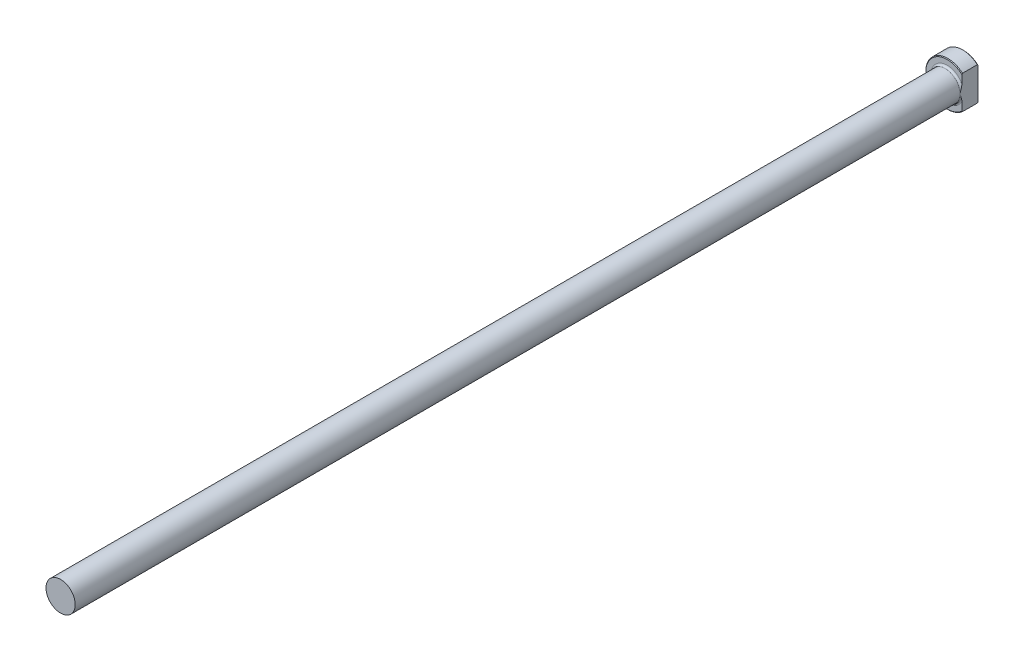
ISO-10303-21;
HEADER;
FILE_DESCRIPTION(('STEP AP214'),'2;1');
FILE_NAME('part.step','',(''),(''),'','','');
FILE_SCHEMA(('AUTOMOTIVE_DESIGN { 1 0 10303 214 1 1 1 1 }'));
ENDSEC;
DATA;
#1=APPLICATION_CONTEXT('core data for automotive mechanical design processes');
#2=APPLICATION_PROTOCOL_DEFINITION('international standard','automotive_design',2000,#1);
#3=PRODUCT_CONTEXT('',#1,'mechanical');
#4=PRODUCT('Part','Part','',(#3));
#5=PRODUCT_RELATED_PRODUCT_CATEGORY('part','',(#4));
#6=PRODUCT_DEFINITION_FORMATION('','',#4);
#7=PRODUCT_DEFINITION_CONTEXT('part definition',#1,'design');
#8=PRODUCT_DEFINITION('design','',#6,#7);
#9=PRODUCT_DEFINITION_SHAPE('','',#8);
#10=(LENGTH_UNIT() NAMED_UNIT(*) SI_UNIT(.MILLI.,.METRE.));
#11=(NAMED_UNIT(*) PLANE_ANGLE_UNIT() SI_UNIT($,.RADIAN.));
#12=(NAMED_UNIT(*) SI_UNIT($,.STERADIAN.) SOLID_ANGLE_UNIT());
#13=UNCERTAINTY_MEASURE_WITH_UNIT(LENGTH_MEASURE(1.E-05),#10,'distance_accuracy_value','');
#14=(GEOMETRIC_REPRESENTATION_CONTEXT(3) GLOBAL_UNCERTAINTY_ASSIGNED_CONTEXT((#13)) GLOBAL_UNIT_ASSIGNED_CONTEXT((#10,
#11,#12)) REPRESENTATION_CONTEXT('',''));
#15=CARTESIAN_POINT('',(0.,0.,0.));
#16=DIRECTION('',(0.,0.,1.));
#17=DIRECTION('',(1.,0.,0.));
#18=AXIS2_PLACEMENT_3D('',#15,#16,#17);
#19=CARTESIAN_POINT('',(0.,5.75436999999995,355.6));
#20=DIRECTION('',(0.,0.,1.));
#21=DIRECTION('',(1.,0.,0.));
#22=AXIS2_PLACEMENT_3D('',#19,#20,#21);
#23=PLANE('',#22);
#24=CARTESIAN_POINT('',(0.,0.,355.6));
#25=DIRECTION('',(0.,0.,-1.));
#26=DIRECTION('',(-1.,0.,0.));
#27=AXIS2_PLACEMENT_3D('',#24,#25,#26);
#28=CIRCLE('',#27,5.75436999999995);
#29=CARTESIAN_POINT('',(-5.75436999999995,0.,355.6));
#30=VERTEX_POINT('',#29);
#31=EDGE_CURVE('E96',#30,#30,#28,.T.);
#32=ORIENTED_EDGE('',*,*,#31,.F.);
#33=EDGE_LOOP('',(#32));
#34=FACE_BOUND('',#33,.T.);
#35=ADVANCED_FACE('F32',(#34),#23,.T.);
#36=CARTESIAN_POINT('',(0.,0.,-25.4347445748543));
#37=DIRECTION('',(0.,0.,-1.));
#38=DIRECTION('',(-1.,0.,0.));
#39=AXIS2_PLACEMENT_3D('',#36,#37,#38);
#40=CYLINDRICAL_SURFACE('',#39,5.75436999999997);
#41=ORIENTED_EDGE('',*,*,#31,.T.);
#42=EDGE_LOOP('',(#41));
#43=FACE_BOUND('',#42,.T.);
#44=CARTESIAN_POINT('',(0.,0.,7.112));
#45=DIRECTION('',(0.,0.,-1.));
#46=DIRECTION('',(-1.,0.,0.));
#47=AXIS2_PLACEMENT_3D('',#44,#45,#46);
#48=CIRCLE('',#47,5.75436999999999);
#49=CARTESIAN_POINT('',(5.75436999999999,0.,7.112));
#50=VERTEX_POINT('',#49);
#51=EDGE_CURVE('E101',#50,#50,#48,.T.);
#52=ORIENTED_EDGE('',*,*,#51,.F.);
#53=EDGE_LOOP('',(#52));
#54=FACE_BOUND('',#53,.T.);
#55=ADVANCED_FACE('F158',(#43,#54),#40,.T.);
#56=CARTESIAN_POINT('',(0.,0.,7.112));
#57=DIRECTION('',(0.,0.,-1.));
#58=DIRECTION('',(-1.,0.,0.));
#59=AXIS2_PLACEMENT_3D('',#56,#57,#58);
#60=TOROIDAL_SURFACE('',#59,6.51636999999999,0.762);
#61=CARTESIAN_POINT('',(5.75436999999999,0.,7.112));
#62=CARTESIAN_POINT('',(5.75436999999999,7.70786930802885E-11,7.11200099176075));
#63=CARTESIAN_POINT('',(5.75436999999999,-2.38318318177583E-07,7.11200198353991));
#64=CARTESIAN_POINT('',(5.75436999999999,-9.73783240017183E-07,7.11200388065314));
#65=CARTESIAN_POINT('',(5.75436999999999,-1.48008442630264E-06,7.11200478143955));
#66=CARTESIAN_POINT('',(5.75436999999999,-2.69223035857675E-06,7.11200658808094));
#67=CARTESIAN_POINT('',(5.75436999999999,-3.41415136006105E-06,7.11200748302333));
#68=CARTESIAN_POINT('',(5.75436999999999,-4.95846600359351E-06,7.11200915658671));
#69=CARTESIAN_POINT('',(5.75436999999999,-5.77957376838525E-06,7.11200993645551));
#70=CARTESIAN_POINT('',(5.75436999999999,-8.76813127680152E-06,7.11201260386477));
#71=CARTESIAN_POINT('',(5.75436999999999,-1.1063971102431E-05,7.11201435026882));
#72=CARTESIAN_POINT('',(5.75436999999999,-1.57667387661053E-05,7.11201741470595));
#73=CARTESIAN_POINT('',(5.75436999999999,-1.81639281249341E-05,7.11201874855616));
#74=CARTESIAN_POINT('',(5.75436999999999,-2.76858847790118E-05,7.11202387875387));
#75=CARTESIAN_POINT('',(5.75436999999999,-3.49518647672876E-05,7.11202742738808));
#76=CARTESIAN_POINT('',(5.75436999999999,-4.91508967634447E-05,7.11203311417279));
#77=CARTESIAN_POINT('',(5.75436999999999,-5.6042112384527E-05,7.11203535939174));
#78=CARTESIAN_POINT('',(5.75436999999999,-8.5850498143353E-05,7.11204509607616));
#79=CARTESIAN_POINT('',(5.75436999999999,-0.000108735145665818,7.1120526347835));
#80=CARTESIAN_POINT('',(5.75436999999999,-0.000151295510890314,7.11206453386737));
#81=CARTESIAN_POINT('',(5.75436999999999,-0.000170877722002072,7.11206921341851));
#82=CARTESIAN_POINT('',(5.75436999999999,-0.000315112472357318,7.11210679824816));
#83=CARTESIAN_POINT('',(5.75436999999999,-0.000435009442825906,7.1121554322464));
#84=CARTESIAN_POINT('',(5.75436999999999,-0.0009041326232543,7.11233884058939));
#85=CARTESIAN_POINT('',(5.75436999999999,-0.0012566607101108,7.1124618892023));
#86=CARTESIAN_POINT('',(5.75436999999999,-0.00263556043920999,7.11295021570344));
#87=CARTESIAN_POINT('',(5.75436999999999,-0.00365856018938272,7.1133277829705));
#88=CARTESIAN_POINT('',(5.75436999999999,-0.00787091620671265,7.11487530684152));
#89=CARTESIAN_POINT('',(5.75436999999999,-0.0110639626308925,7.11603146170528));
#90=CARTESIAN_POINT('',(5.75436999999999,-0.0800513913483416,7.14102015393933));
#91=CARTESIAN_POINT('',(5.75436999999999,-0.145801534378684,7.16502028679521));
#92=CARTESIAN_POINT('',(5.75436999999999,-0.274865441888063,7.21183948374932));
#93=CARTESIAN_POINT('',(5.75436999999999,-0.338175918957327,7.23466853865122));
#94=CARTESIAN_POINT('',(5.75436999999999,-0.472552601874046,7.28278742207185));
#95=CARTESIAN_POINT('',(5.75436999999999,-0.543631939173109,7.30804141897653));
#96=CARTESIAN_POINT('',(5.75436999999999,-0.686750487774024,7.35821858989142));
#97=CARTESIAN_POINT('',(5.75436999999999,-0.758791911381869,7.38313545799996));
#98=CARTESIAN_POINT('',(5.75436999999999,-0.883588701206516,7.42550596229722));
#99=CARTESIAN_POINT('',(5.75436999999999,-0.936278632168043,7.44315185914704));
#100=CARTESIAN_POINT('',(5.75436999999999,-1.04170092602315,7.47787162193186));
#101=CARTESIAN_POINT('',(5.75436999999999,-1.09443285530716,7.4949468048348));
#102=CARTESIAN_POINT('',(5.75436999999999,-1.25048082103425,7.54446799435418));
#103=CARTESIAN_POINT('',(5.75436999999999,-1.35407609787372,7.57604224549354));
#104=CARTESIAN_POINT('',(5.75436999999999,-1.58368146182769,7.64226859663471));
#105=CARTESIAN_POINT('',(5.75436999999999,-1.70989991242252,7.6762085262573));
#106=CARTESIAN_POINT('',(5.75436999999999,-1.96483910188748,7.73821208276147));
#107=CARTESIAN_POINT('',(5.75436999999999,-2.09357165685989,7.76622807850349));
#108=CARTESIAN_POINT('',(5.75436999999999,-2.36181509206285,7.81576826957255));
#109=CARTESIAN_POINT('',(5.75436999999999,-2.50144062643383,7.83668800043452));
#110=CARTESIAN_POINT('',(5.75436999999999,-2.78172022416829,7.86589189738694));
#111=CARTESIAN_POINT('',(5.75436999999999,-2.92236952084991,7.87421657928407));
#112=CARTESIAN_POINT('',(5.75436999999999,-3.13204289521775,7.87388789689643));
#113=CARTESIAN_POINT('',(5.75436999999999,-3.20108015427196,7.87172012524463));
#114=CARTESIAN_POINT('',(5.75436999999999,-3.33881497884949,7.86251334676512));
#115=CARTESIAN_POINT('',(5.75436999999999,-3.40751271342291,7.855477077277));
#116=CARTESIAN_POINT('',(5.75436999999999,-3.54306949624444,7.83576939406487));
#117=CARTESIAN_POINT('',(5.75436999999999,-3.60994066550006,7.82318415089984));
#118=CARTESIAN_POINT('',(5.75436999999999,-3.74201177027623,7.79128124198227));
#119=CARTESIAN_POINT('',(5.75436999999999,-3.80721402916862,7.77197355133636));
#120=CARTESIAN_POINT('',(5.75436999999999,-3.93534327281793,7.72492874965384));
#121=CARTESIAN_POINT('',(5.75436999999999,-3.99823971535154,7.69710644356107));
#122=CARTESIAN_POINT('',(5.75436999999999,-4.118489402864,7.63116625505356));
#123=CARTESIAN_POINT('',(5.75436999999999,-4.17585904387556,7.59308018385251));
#124=CARTESIAN_POINT('',(5.75436999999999,-4.25451777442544,7.52651334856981));
#125=CARTESIAN_POINT('',(5.75436999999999,-4.2796407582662,7.50256783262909));
#126=CARTESIAN_POINT('',(5.75436999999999,-4.32630222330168,7.45135030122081));
#127=CARTESIAN_POINT('',(5.75436999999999,-4.34784090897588,7.42407847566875));
#128=CARTESIAN_POINT('',(5.75436999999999,-4.38633735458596,7.36593665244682));
#129=CARTESIAN_POINT('',(5.75436999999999,-4.40323665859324,7.33502718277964));
#130=CARTESIAN_POINT('',(5.75436999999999,-4.43062972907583,7.27048381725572));
#131=CARTESIAN_POINT('',(5.75436999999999,-4.44113552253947,7.23685517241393));
#132=CARTESIAN_POINT('',(5.75436999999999,-4.45369945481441,7.17262116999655));
#133=CARTESIAN_POINT('',(5.75436999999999,-4.45668499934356,7.14219793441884));
#134=CARTESIAN_POINT('',(5.75436999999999,-4.45665226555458,7.08135673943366));
#135=CARTESIAN_POINT('',(5.75436999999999,-4.45363600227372,7.05093878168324));
#136=CARTESIAN_POINT('',(5.75436999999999,-4.44268144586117,6.99515068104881));
#137=CARTESIAN_POINT('',(5.75436999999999,-4.43543615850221,6.96963947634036));
#138=CARTESIAN_POINT('',(5.75436999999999,-4.41714360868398,6.92003417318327));
#139=CARTESIAN_POINT('',(5.75436999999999,-4.40609555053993,6.89594037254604));
#140=CARTESIAN_POINT('',(5.75436999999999,-4.37580210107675,6.84035984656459));
#141=CARTESIAN_POINT('',(5.75436999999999,-4.3550419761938,6.80969960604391));
#142=CARTESIAN_POINT('',(5.75436999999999,-4.30886157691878,6.75210891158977));
#143=CARTESIAN_POINT('',(5.75436999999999,-4.28343021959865,6.72518760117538));
#144=CARTESIAN_POINT('',(5.75436999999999,-4.21593827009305,6.66271931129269));
#145=CARTESIAN_POINT('',(5.75436999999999,-4.17183014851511,6.6293982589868));
#146=CARTESIAN_POINT('',(5.75436999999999,-4.07914350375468,6.56993367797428));
#147=CARTESIAN_POINT('',(5.75436999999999,-4.03056203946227,6.54379491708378));
#148=CARTESIAN_POINT('',(5.75436999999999,-3.93832488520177,6.50114722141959));
#149=CARTESIAN_POINT('',(5.75436999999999,-3.89505907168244,6.48377578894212));
#150=CARTESIAN_POINT('',(5.75436999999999,-3.80718014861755,6.45281296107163));
#151=CARTESIAN_POINT('',(5.75436999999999,-3.76256604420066,6.43922443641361));
#152=CARTESIAN_POINT('',(5.75436999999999,-3.62658801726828,6.40317986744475));
#153=CARTESIAN_POINT('',(5.75436999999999,-3.5338780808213,6.38578333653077));
#154=CARTESIAN_POINT('',(5.75436999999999,-3.34935901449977,6.36166742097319));
#155=CARTESIAN_POINT('',(5.75436999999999,-3.25757654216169,6.35471663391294));
#156=CARTESIAN_POINT('',(5.75436999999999,-3.07359065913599,6.34873483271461));
#157=CARTESIAN_POINT('',(5.75436999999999,-2.98138676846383,6.34972066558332));
#158=CARTESIAN_POINT('',(5.75436999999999,-2.80104090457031,6.35797851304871));
#159=CARTESIAN_POINT('',(5.75436999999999,-2.71288574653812,6.36499416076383));
#160=CARTESIAN_POINT('',(5.75436999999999,-2.53755072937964,6.3838938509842));
#161=CARTESIAN_POINT('',(5.75436999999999,-2.45036820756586,6.39575385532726));
#162=CARTESIAN_POINT('',(5.75436999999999,-2.27656334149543,6.42353835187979));
#163=CARTESIAN_POINT('',(5.75436999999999,-2.18994174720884,6.43946745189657));
#164=CARTESIAN_POINT('',(5.75436999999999,-2.01743688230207,6.47469644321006));
#165=CARTESIAN_POINT('',(5.75436999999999,-1.93155328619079,6.49399475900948));
#166=CARTESIAN_POINT('',(5.75436999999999,-1.75854118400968,6.53585898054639));
#167=CARTESIAN_POINT('',(5.75436999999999,-1.67142825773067,6.55848873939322));
#168=CARTESIAN_POINT('',(5.75436999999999,-1.49764821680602,6.60620520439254));
#169=CARTESIAN_POINT('',(5.75436999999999,-1.41098276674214,6.63129792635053));
#170=CARTESIAN_POINT('',(5.75436999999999,-1.2079405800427,6.69256019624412));
#171=CARTESIAN_POINT('',(5.75436999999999,-1.09180568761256,6.729527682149));
#172=CARTESIAN_POINT('',(5.75436999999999,-0.861590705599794,6.80555564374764));
#173=CARTESIAN_POINT('',(5.75436999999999,-0.747501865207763,6.84458991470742));
#174=CARTESIAN_POINT('',(5.75436999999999,-0.583036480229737,6.90210759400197));
#175=CARTESIAN_POINT('',(5.75436999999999,-0.532441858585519,6.91997318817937));
#176=CARTESIAN_POINT('',(5.75436999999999,-0.431131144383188,6.95601354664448));
#177=CARTESIAN_POINT('',(5.75436999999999,-0.380415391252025,6.97418927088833));
#178=CARTESIAN_POINT('',(5.75436999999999,-0.276706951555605,7.01151894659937));
#179=CARTESIAN_POINT('',(5.75436999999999,-0.22371671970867,7.03067947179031));
#180=CARTESIAN_POINT('',(5.75436999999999,-0.118582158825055,7.06887639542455));
#181=CARTESIAN_POINT('',(5.75436999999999,-0.0664370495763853,7.08791035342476));
#182=CARTESIAN_POINT('',(5.75436999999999,-0.0110623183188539,7.10796918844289));
#183=CARTESIAN_POINT('',(5.75436999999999,-0.00786760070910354,7.10912589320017));
#184=CARTESIAN_POINT('',(5.75436999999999,-0.00365484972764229,7.11067356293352));
#185=CARTESIAN_POINT('',(5.75436999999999,-0.00263310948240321,7.11105066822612));
#186=CARTESIAN_POINT('',(5.75436999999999,-0.00125579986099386,7.11153843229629));
#187=CARTESIAN_POINT('',(5.75436999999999,-0.000903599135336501,7.11166136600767));
#188=CARTESIAN_POINT('',(5.75436999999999,-0.000434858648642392,7.11184462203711));
#189=CARTESIAN_POINT('',(5.75436999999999,-0.000315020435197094,7.11189323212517));
#190=CARTESIAN_POINT('',(5.75436999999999,-0.000170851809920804,7.11193080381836));
#191=CARTESIAN_POINT('',(5.75436999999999,-0.000151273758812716,7.1119354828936));
#192=CARTESIAN_POINT('',(5.75436999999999,-0.000108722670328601,7.11194737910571));
#193=CARTESIAN_POINT('',(5.75436999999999,-8.58430284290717E-05,7.11195491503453));
#194=CARTESIAN_POINT('',(5.75436999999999,-5.6040246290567E-05,7.11196464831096));
#195=CARTESIAN_POINT('',(5.75436999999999,-4.91496515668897E-05,7.11196689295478));
#196=CARTESIAN_POINT('',(5.75436999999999,-3.49518101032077E-05,7.11197257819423));
#197=CARTESIAN_POINT('',(5.75436999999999,-2.76863749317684E-05,7.11197612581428));
#198=CARTESIAN_POINT('',(5.75436999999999,-1.81649420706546E-05,7.11198125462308));
#199=CARTESIAN_POINT('',(5.75436999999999,-1.57678004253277E-05,7.11198258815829));
#200=CARTESIAN_POINT('',(5.75436999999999,-1.10650672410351E-05,7.11198565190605));
#201=CARTESIAN_POINT('',(5.75436999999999,-8.76921030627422E-06,7.11198739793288));
#202=CARTESIAN_POINT('',(5.75436999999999,-5.78055699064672E-06,7.11199006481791));
#203=CARTESIAN_POINT('',(5.75436999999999,-4.9594069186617E-06,7.11199084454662));
#204=CARTESIAN_POINT('',(5.75436999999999,-3.41498248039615E-06,7.11199251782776));
#205=CARTESIAN_POINT('',(5.75436999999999,-2.69299361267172E-06,7.11199341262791));
#206=CARTESIAN_POINT('',(5.75436999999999,-1.48068422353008E-06,7.11199521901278));
#207=CARTESIAN_POINT('',(5.75436999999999,-9.74291406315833E-07,7.11199611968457));
#208=CARTESIAN_POINT('',(5.75436999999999,-2.38602594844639E-07,7.11199801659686));
#209=CARTESIAN_POINT('',(5.75436999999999,-7.70748094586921E-11,7.11199900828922));
#210=CARTESIAN_POINT('',(5.75436999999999,0.,7.112));
#211=B_SPLINE_CURVE_WITH_KNOTS('',3,(#61,#62,#63,#64,#65,#66,#67,#68,#69,#70,#71,#72,#73,#74,
#75,#76,#77,#78,#79,#80,#81,#82,#83,#84,#85,#86,#87,#88,#89,#90,#91,#92,#93,#94,#95,#96,#97,#98,
#99,#100,#101,#102,#103,#104,#105,#106,#107,#108,#109,#110,#111,#112,#113,#114,#115,#116,#117,
#118,#119,#120,#121,#122,#123,#124,#125,#126,#127,#128,#129,#130,#131,#132,#133,#134,#135,#136,
#137,#138,#139,#140,#141,#142,#143,#144,#145,#146,#147,#148,#149,#150,#151,#152,#153,#154,#155,
#156,#157,#158,#159,#160,#161,#162,#163,#164,#165,#166,#167,#168,#169,#170,#171,#172,#173,#174,
#175,#176,#177,#178,#179,#180,#181,#182,#183,#184,#185,#186,#187,#188,#189,#190,#191,#192,#193,
#194,#195,#196,#197,#198,#199,#200,#201,#202,#203,#204,#205,#206,#207,#208,#209,#210),
.UNSPECIFIED.,.T.,.F.,(4,2,2,2,2,2,2,2,2,2,2,2,2,2,2,2,2,2,2,2,2,2,2,2,2,2,2,2,2,2,2,2,2,2,2,2,
2,2,2,2,2,2,2,2,2,2,2,2,2,2,2,2,2,2,2,2,2,2,2,2,2,2,2,2,2,2,2,2,2,2,2,2,2,2,4),(0.,
2.97587796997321E-06,6.06170394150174E-06,9.49596710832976E-06,1.28897124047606E-05,
2.15030363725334E-05,2.97263138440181E-05,5.39175273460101E-05,7.5637036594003E-05,
0.000147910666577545,0.000208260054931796,0.000595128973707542,0.0017163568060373,
0.00498636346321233,0.0151755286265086,0.225135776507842,0.427042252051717,0.65333617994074,
0.882018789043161,1.04871495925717,1.21499536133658,1.53986014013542,1.93185346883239,
2.32688788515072,2.75005715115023,3.1718622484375,3.3789420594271,3.5859055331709,
3.78976242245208,3.99331809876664,4.19898105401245,4.40401377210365,4.50786357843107,
4.61170745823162,4.71680526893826,4.82170476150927,4.9128430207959,5.00395068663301,
5.08317976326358,5.16242542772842,5.27288753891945,5.38361519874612,5.54852887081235,
5.71355175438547,5.85322225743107,5.99299846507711,6.27510055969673,6.55085610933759,
6.82719715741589,7.09233946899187,7.35618180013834,7.62032423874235,7.88434348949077,
8.1543144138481,8.42496197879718,8.7905479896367,9.15227590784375,9.31324464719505,
9.47486614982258,9.6439140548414,9.81042953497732,9.82062398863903,9.82388997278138,
9.82501015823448,9.82539683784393,9.82545717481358,9.82552943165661,9.82555114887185,
9.8255753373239,9.8255835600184,9.82559217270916,9.82559556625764,9.82559900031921,
9.82560208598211,9.82560506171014),.UNSPECIFIED.);
#212=CARTESIAN_POINT('',(5.75436999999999,-3.05782665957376,6.35));
#213=VERTEX_POINT('',#212);
#214=EDGE_CURVE('E142',#213,#50,#211,.T.);
#215=ORIENTED_EDGE('',*,*,#214,.T.);
#216=ORIENTED_EDGE('',*,*,#51,.T.);
#217=CARTESIAN_POINT('',(5.75436999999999,0.,7.112));
#218=CARTESIAN_POINT('',(5.75436999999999,-7.70785673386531E-11,7.11199900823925));
#219=CARTESIAN_POINT('',(5.75436999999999,2.38318318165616E-07,7.11199801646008));
#220=CARTESIAN_POINT('',(5.75436999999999,9.73783239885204E-07,7.11199611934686));
#221=CARTESIAN_POINT('',(5.75436999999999,1.48008442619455E-06,7.11199521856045));
#222=CARTESIAN_POINT('',(5.75436999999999,2.69223035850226E-06,7.11199341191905));
#223=CARTESIAN_POINT('',(5.75436999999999,3.41415135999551E-06,7.11199251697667));
#224=CARTESIAN_POINT('',(5.75436999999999,4.9584660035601E-06,7.11199084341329));
#225=CARTESIAN_POINT('',(5.75436999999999,5.77957376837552E-06,7.11199006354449));
#226=CARTESIAN_POINT('',(5.75436999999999,8.76813127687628E-06,7.11198739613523));
#227=CARTESIAN_POINT('',(5.75436999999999,1.1063971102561E-05,7.11198564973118));
#228=CARTESIAN_POINT('',(5.75436999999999,1.57667387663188E-05,7.11198258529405));
#229=CARTESIAN_POINT('',(5.75436999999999,1.81639281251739E-05,7.11198125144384));
#230=CARTESIAN_POINT('',(5.75436999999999,2.76858847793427E-05,7.11197612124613));
#231=CARTESIAN_POINT('',(5.75436999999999,3.49518647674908E-05,7.11197257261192));
#232=CARTESIAN_POINT('',(5.75436999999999,4.91508967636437E-05,7.11196688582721));
#233=CARTESIAN_POINT('',(5.75436999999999,5.60421123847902E-05,7.11196464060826));
#234=CARTESIAN_POINT('',(5.75436999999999,8.58504981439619E-05,7.11195490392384));
#235=CARTESIAN_POINT('',(5.75436999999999,0.000108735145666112,7.1119473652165));
#236=CARTESIAN_POINT('',(5.75436999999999,0.000151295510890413,7.11193546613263));
#237=CARTESIAN_POINT('',(5.75436999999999,0.000170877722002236,7.11193078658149));
#238=CARTESIAN_POINT('',(5.75436999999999,0.000315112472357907,7.11189320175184));
#239=CARTESIAN_POINT('',(5.75436999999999,0.000435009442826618,7.1118445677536));
#240=CARTESIAN_POINT('',(5.75436999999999,0.000904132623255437,7.11166115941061));
#241=CARTESIAN_POINT('',(5.75436999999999,0.00125666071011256,7.1115381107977));
#242=CARTESIAN_POINT('',(5.75436999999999,0.00263556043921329,7.11104978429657));
#243=CARTESIAN_POINT('',(5.75436999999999,0.00365856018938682,7.11067221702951));
#244=CARTESIAN_POINT('',(5.75436999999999,0.00787091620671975,7.1091246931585));
#245=CARTESIAN_POINT('',(5.75436999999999,0.0110639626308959,7.10796853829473));
#246=CARTESIAN_POINT('',(5.75436999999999,0.0800513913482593,7.08297984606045));
#247=CARTESIAN_POINT('',(5.75436999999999,0.145801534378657,7.05897971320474));
#248=CARTESIAN_POINT('',(5.75436999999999,0.274865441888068,7.01216051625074));
#249=CARTESIAN_POINT('',(5.75436999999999,0.338175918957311,6.9893314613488));
#250=CARTESIAN_POINT('',(5.75436999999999,0.472552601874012,6.94121257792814));
#251=CARTESIAN_POINT('',(5.75436999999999,0.54363193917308,6.91595858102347));
#252=CARTESIAN_POINT('',(5.75436999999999,0.686750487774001,6.86578141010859));
#253=CARTESIAN_POINT('',(5.75436999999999,0.758791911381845,6.84086454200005));
#254=CARTESIAN_POINT('',(5.75436999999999,0.883588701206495,6.79849403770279));
#255=CARTESIAN_POINT('',(5.75436999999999,0.936278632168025,6.78084814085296));
#256=CARTESIAN_POINT('',(5.75436999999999,1.04170092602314,6.74612837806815));
#257=CARTESIAN_POINT('',(5.75436999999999,1.09443285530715,6.7290531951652));
#258=CARTESIAN_POINT('',(5.75436999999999,1.25048082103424,6.67953200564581));
#259=CARTESIAN_POINT('',(5.75436999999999,1.35407609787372,6.64795775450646));
#260=CARTESIAN_POINT('',(5.75436999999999,1.58368146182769,6.58173140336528));
#261=CARTESIAN_POINT('',(5.75436999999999,1.70989991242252,6.5477914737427));
#262=CARTESIAN_POINT('',(5.75436999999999,1.96483910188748,6.48578791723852));
#263=CARTESIAN_POINT('',(5.75436999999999,2.09357165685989,6.4577719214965));
#264=CARTESIAN_POINT('',(5.75436999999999,2.36181509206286,6.40823173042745));
#265=CARTESIAN_POINT('',(5.75436999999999,2.50144062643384,6.38731199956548));
#266=CARTESIAN_POINT('',(5.75436999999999,2.7817202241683,6.35810810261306));
#267=CARTESIAN_POINT('',(5.75436999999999,2.92236952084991,6.34978342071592));
#268=CARTESIAN_POINT('',(5.75436999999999,3.13204289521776,6.35011210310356));
#269=CARTESIAN_POINT('',(5.75436999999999,3.20108015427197,6.35227987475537));
#270=CARTESIAN_POINT('',(5.75436999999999,3.3388149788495,6.36148665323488));
#271=CARTESIAN_POINT('',(5.75436999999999,3.40751271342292,6.368522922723));
#272=CARTESIAN_POINT('',(5.75436999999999,3.54306949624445,6.38823060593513));
#273=CARTESIAN_POINT('',(5.75436999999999,3.60994066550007,6.40081584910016));
#274=CARTESIAN_POINT('',(5.75436999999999,3.74201177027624,6.43271875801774));
#275=CARTESIAN_POINT('',(5.75436999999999,3.80721402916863,6.45202644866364));
#276=CARTESIAN_POINT('',(5.75436999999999,3.93534327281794,6.49907125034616));
#277=CARTESIAN_POINT('',(5.75436999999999,3.99823971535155,6.52689355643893));
#278=CARTESIAN_POINT('',(5.75436999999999,4.11848940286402,6.59283374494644));
#279=CARTESIAN_POINT('',(5.75436999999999,4.17585904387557,6.63091981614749));
#280=CARTESIAN_POINT('',(5.75436999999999,4.25451777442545,6.69748665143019));
#281=CARTESIAN_POINT('',(5.75436999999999,4.27964075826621,6.72143216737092));
#282=CARTESIAN_POINT('',(5.75436999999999,4.32630222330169,6.7726496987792));
#283=CARTESIAN_POINT('',(5.75436999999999,4.34784090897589,6.79992152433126));
#284=CARTESIAN_POINT('',(5.75436999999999,4.38633735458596,6.85806334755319));
#285=CARTESIAN_POINT('',(5.75436999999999,4.40323665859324,6.88897281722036));
#286=CARTESIAN_POINT('',(5.75436999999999,4.43062972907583,6.95351618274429));
#287=CARTESIAN_POINT('',(5.75436999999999,4.44113552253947,6.98714482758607));
#288=CARTESIAN_POINT('',(5.75436999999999,4.45369945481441,7.05137883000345));
#289=CARTESIAN_POINT('',(5.75436999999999,4.45668499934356,7.08180206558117));
#290=CARTESIAN_POINT('',(5.75436999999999,4.45665226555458,7.14264326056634));
#291=CARTESIAN_POINT('',(5.75436999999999,4.45363600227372,7.17306121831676));
#292=CARTESIAN_POINT('',(5.75436999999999,4.44268144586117,7.22884931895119));
#293=CARTESIAN_POINT('',(5.75436999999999,4.43543615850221,7.25436052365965));
#294=CARTESIAN_POINT('',(5.75436999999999,4.41714360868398,7.30396582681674));
#295=CARTESIAN_POINT('',(5.75436999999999,4.40609555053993,7.32805962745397));
#296=CARTESIAN_POINT('',(5.75436999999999,4.37580210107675,7.38364015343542));
#297=CARTESIAN_POINT('',(5.75436999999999,4.3550419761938,7.41430039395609));
#298=CARTESIAN_POINT('',(5.75436999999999,4.30886157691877,7.47189108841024));
#299=CARTESIAN_POINT('',(5.75436999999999,4.28343021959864,7.49881239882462));
#300=CARTESIAN_POINT('',(5.75436999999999,4.21593827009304,7.56128068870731));
#301=CARTESIAN_POINT('',(5.75436999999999,4.1718301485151,7.5946017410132));
#302=CARTESIAN_POINT('',(5.75436999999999,4.07914350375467,7.65406632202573));
#303=CARTESIAN_POINT('',(5.75436999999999,4.03056203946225,7.68020508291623));
#304=CARTESIAN_POINT('',(5.75436999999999,3.93832488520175,7.72285277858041));
#305=CARTESIAN_POINT('',(5.75436999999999,3.89505907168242,7.74022421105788));
#306=CARTESIAN_POINT('',(5.75436999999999,3.80718014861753,7.77118703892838));
#307=CARTESIAN_POINT('',(5.75436999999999,3.76256604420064,7.7847755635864));
#308=CARTESIAN_POINT('',(5.75436999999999,3.62658801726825,7.82082013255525));
#309=CARTESIAN_POINT('',(5.75436999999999,3.53387808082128,7.83821666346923));
#310=CARTESIAN_POINT('',(5.75436999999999,3.34935901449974,7.86233257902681));
#311=CARTESIAN_POINT('',(5.75436999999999,3.25757654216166,7.86928336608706));
#312=CARTESIAN_POINT('',(5.75436999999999,3.07359065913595,7.87526516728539));
#313=CARTESIAN_POINT('',(5.75436999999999,2.98138676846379,7.87427933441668));
#314=CARTESIAN_POINT('',(5.75436999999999,2.80104090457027,7.86602148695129));
#315=CARTESIAN_POINT('',(5.75436999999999,2.71288574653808,7.85900583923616));
#316=CARTESIAN_POINT('',(5.75436999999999,2.53755072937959,7.84010614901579));
#317=CARTESIAN_POINT('',(5.75436999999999,2.4503682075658,7.82824614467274));
#318=CARTESIAN_POINT('',(5.75436999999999,2.27656334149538,7.8004616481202));
#319=CARTESIAN_POINT('',(5.75436999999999,2.18994174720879,7.78453254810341));
#320=CARTESIAN_POINT('',(5.75436999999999,2.01743688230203,7.74930355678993));
#321=CARTESIAN_POINT('',(5.75436999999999,1.93155328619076,7.73000524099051));
#322=CARTESIAN_POINT('',(5.75436999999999,1.75854118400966,7.6881410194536));
#323=CARTESIAN_POINT('',(5.75436999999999,1.67142825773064,7.66551126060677));
#324=CARTESIAN_POINT('',(5.75436999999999,1.497648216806,7.61779479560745));
#325=CARTESIAN_POINT('',(5.75436999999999,1.41098276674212,7.59270207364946));
#326=CARTESIAN_POINT('',(5.75436999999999,1.20794058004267,7.53143980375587));
#327=CARTESIAN_POINT('',(5.75436999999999,1.09180568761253,7.49447231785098));
#328=CARTESIAN_POINT('',(5.75436999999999,0.861590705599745,7.41844435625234));
#329=CARTESIAN_POINT('',(5.75436999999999,0.747501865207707,7.37941008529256));
#330=CARTESIAN_POINT('',(5.75436999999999,0.58303648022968,7.32189240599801));
#331=CARTESIAN_POINT('',(5.75436999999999,0.532441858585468,7.30402681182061));
#332=CARTESIAN_POINT('',(5.75436999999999,0.431131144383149,7.2679864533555));
#333=CARTESIAN_POINT('',(5.75436999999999,0.380415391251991,7.24981072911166));
#334=CARTESIAN_POINT('',(5.75436999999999,0.276706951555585,7.21248105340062));
#335=CARTESIAN_POINT('',(5.75436999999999,0.223716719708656,7.19332052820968));
#336=CARTESIAN_POINT('',(5.75436999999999,0.118582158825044,7.15512360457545));
#337=CARTESIAN_POINT('',(5.75436999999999,0.0664370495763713,7.13608964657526));
#338=CARTESIAN_POINT('',(5.75436999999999,0.011062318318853,7.11603081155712));
#339=CARTESIAN_POINT('',(5.75436999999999,0.00786760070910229,7.11487410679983));
#340=CARTESIAN_POINT('',(5.75436999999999,0.00365484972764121,7.11332643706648));
#341=CARTESIAN_POINT('',(5.75436999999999,0.00263310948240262,7.11294933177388));
#342=CARTESIAN_POINT('',(5.75436999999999,0.00125579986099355,7.11246156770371));
#343=CARTESIAN_POINT('',(5.75436999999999,0.00090359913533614,7.11233863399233));
#344=CARTESIAN_POINT('',(5.75436999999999,0.00043485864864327,7.11215537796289));
#345=CARTESIAN_POINT('',(5.75436999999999,0.000315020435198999,7.11210676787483));
#346=CARTESIAN_POINT('',(5.75436999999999,0.000170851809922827,7.11206919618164));
#347=CARTESIAN_POINT('',(5.75436999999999,0.000151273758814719,7.1120645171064));
#348=CARTESIAN_POINT('',(5.75436999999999,0.000108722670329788,7.11205262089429));
#349=CARTESIAN_POINT('',(5.75436999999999,8.58430284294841E-05,7.11204508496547));
#350=CARTESIAN_POINT('',(5.75436999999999,5.604024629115E-05,7.11203535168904));
#351=CARTESIAN_POINT('',(5.75436999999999,4.91496515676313E-05,7.11203310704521));
#352=CARTESIAN_POINT('',(5.75436999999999,3.49518101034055E-05,7.11202742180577));
#353=CARTESIAN_POINT('',(5.75436999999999,2.76863749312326E-05,7.11202387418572));
#354=CARTESIAN_POINT('',(5.75436999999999,1.81649420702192E-05,7.11201874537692));
#355=CARTESIAN_POINT('',(5.75436999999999,1.57678004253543E-05,7.1120174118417));
#356=CARTESIAN_POINT('',(5.75436999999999,1.10650672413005E-05,7.11201434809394));
#357=CARTESIAN_POINT('',(5.75436999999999,8.76921030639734E-06,7.11201260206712));
#358=CARTESIAN_POINT('',(5.75436999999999,5.780556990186E-06,7.11200993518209));
#359=CARTESIAN_POINT('',(5.75436999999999,4.95940691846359E-06,7.11200915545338));
#360=CARTESIAN_POINT('',(5.75436999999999,3.41498248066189E-06,7.11200748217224));
#361=CARTESIAN_POINT('',(5.75436999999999,2.69299361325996E-06,7.11200658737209));
#362=CARTESIAN_POINT('',(5.75436999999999,1.48068422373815E-06,7.11200478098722));
#363=CARTESIAN_POINT('',(5.75436999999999,9.74291405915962E-07,7.11200388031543));
#364=CARTESIAN_POINT('',(5.75436999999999,2.38602594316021E-07,7.11200198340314));
#365=CARTESIAN_POINT('',(5.75436999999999,7.70746837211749E-11,7.11200099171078));
#366=CARTESIAN_POINT('',(5.75436999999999,0.,7.112));
#367=B_SPLINE_CURVE_WITH_KNOTS('',3,(#217,#218,#219,#220,#221,#222,#223,#224,#225,#226,#227,
#228,#229,#230,#231,#232,#233,#234,#235,#236,#237,#238,#239,#240,#241,#242,#243,#244,#245,#246,
#247,#248,#249,#250,#251,#252,#253,#254,#255,#256,#257,#258,#259,#260,#261,#262,#263,#264,#265,
#266,#267,#268,#269,#270,#271,#272,#273,#274,#275,#276,#277,#278,#279,#280,#281,#282,#283,#284,
#285,#286,#287,#288,#289,#290,#291,#292,#293,#294,#295,#296,#297,#298,#299,#300,#301,#302,#303,
#304,#305,#306,#307,#308,#309,#310,#311,#312,#313,#314,#315,#316,#317,#318,#319,#320,#321,#322,
#323,#324,#325,#326,#327,#328,#329,#330,#331,#332,#333,#334,#335,#336,#337,#338,#339,#340,#341,
#342,#343,#344,#345,#346,#347,#348,#349,#350,#351,#352,#353,#354,#355,#356,#357,#358,#359,#360,
#361,#362,#363,#364,#365,#366),.UNSPECIFIED.,.T.,.F.,(4,2,2,2,2,2,2,2,2,2,2,2,2,2,2,2,2,2,2,2,2,
2,2,2,2,2,2,2,2,2,2,2,2,2,2,2,2,2,2,2,2,2,2,2,2,2,2,2,2,2,2,2,2,2,2,2,2,2,2,2,2,2,2,2,2,2,2,2,2,
2,2,2,2,2,4),(0.,2.97587796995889E-06,6.0617039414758E-06,9.49596710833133E-06,
1.28897124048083E-05,2.15030363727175E-05,2.97263138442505E-05,5.39175273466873E-05,
7.56370365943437E-05,0.000147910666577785,0.000208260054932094,0.000595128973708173,
0.00171635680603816,0.00498636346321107,0.0151755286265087,0.22513577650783,0.427042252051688,
0.653336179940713,0.882018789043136,1.04871495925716,1.21499536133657,1.53986014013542,
1.93185346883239,2.32688788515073,2.75005715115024,3.17186224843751,3.37894205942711,
3.58590553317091,3.78976242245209,3.99331809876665,4.19898105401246,4.40401377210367,
4.50786357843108,4.61170745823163,4.71680526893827,4.82170476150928,4.91284302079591,
5.00395068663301,5.08317976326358,5.16242542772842,5.27288753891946,5.38361519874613,
5.54852887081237,5.71355175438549,5.85322225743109,5.99299846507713,6.27510055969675,
6.55085610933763,6.82719715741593,7.09233946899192,7.35618180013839,7.6203242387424,
7.8843434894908,8.15431441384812,8.4249619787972,8.79054798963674,9.15227590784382,
9.3132446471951,9.47486614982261,9.64391405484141,9.81042953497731,9.82062398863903,
9.82388997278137,9.82501015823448,9.82539683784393,9.82545717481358,9.82552943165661,
9.82555114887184,9.8255753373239,9.8255835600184,9.82559217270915,9.82559556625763,
9.82559900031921,9.82560208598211,9.82560506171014),.UNSPECIFIED.);
#368=CARTESIAN_POINT('',(5.75436999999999,3.05782665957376,6.35));
#369=VERTEX_POINT('',#368);
#370=EDGE_CURVE('E136',#50,#369,#367,.T.);
#371=ORIENTED_EDGE('',*,*,#370,.T.);
#372=CARTESIAN_POINT('',(0.,0.,6.35));
#373=DIRECTION('',(0.,0.,-1.));
#374=DIRECTION('',(-1.,0.,0.));
#375=AXIS2_PLACEMENT_3D('',#372,#373,#374);
#376=CIRCLE('',#375,6.51636999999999);
#377=EDGE_CURVE('E149',#213,#369,#376,.T.);
#378=ORIENTED_EDGE('',*,*,#377,.F.);
#379=EDGE_LOOP('',(#215,#216,#371,#378));
#380=FACE_BOUND('',#379,.T.);
#381=ADVANCED_FACE('F155',(#380),#60,.F.);
#382=CARTESIAN_POINT('',(0.,8.7249,6.35));
#383=DIRECTION('',(0.,0.,1.));
#384=DIRECTION('',(1.,0.,0.));
#385=AXIS2_PLACEMENT_3D('',#382,#383,#384);
#386=PLANE('',#385);
#387=DIRECTION('',(0.,1.,0.));
#388=VECTOR('',#387,1.);
#389=CARTESIAN_POINT('',(5.75436999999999,6.55828528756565,6.35000000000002));
#390=LINE('',#389,#388);
#391=CARTESIAN_POINT('',(5.75436999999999,6.2163793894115,6.35));
#392=VERTEX_POINT('',#391);
#393=EDGE_CURVE('E112',#369,#392,#390,.T.);
#394=ORIENTED_EDGE('',*,*,#393,.T.);
#395=CARTESIAN_POINT('',(0.,0.,6.35));
#396=DIRECTION('',(0.,0.,1.));
#397=DIRECTION('',(1.,0.,0.));
#398=AXIS2_PLACEMENT_3D('',#395,#396,#397);
#399=CIRCLE('',#398,8.47090000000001);
#400=CARTESIAN_POINT('',(5.75436999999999,-6.2163793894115,6.35));
#401=VERTEX_POINT('',#400);
#402=EDGE_CURVE('E11',#392,#401,#399,.T.);
#403=ORIENTED_EDGE('',*,*,#402,.T.);
#404=EDGE_CURVE('E47',#401,#213,#390,.T.);
#405=ORIENTED_EDGE('',*,*,#404,.T.);
#406=ORIENTED_EDGE('',*,*,#377,.T.);
#407=EDGE_LOOP('',(#394,#403,#405,#406));
#408=FACE_BOUND('',#407,.T.);
#409=ADVANCED_FACE('F166',(#408),#386,.T.);
#410=CARTESIAN_POINT('',(0.,0.,-25.4347445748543));
#411=DIRECTION('',(0.,0.,-1.));
#412=DIRECTION('',(-1.,0.,0.));
#413=AXIS2_PLACEMENT_3D('',#410,#411,#412);
#414=CYLINDRICAL_SURFACE('',#413,8.7249);
#415=DIRECTION('',(0.,0.,-1.));
#416=VECTOR('',#415,1.);
#417=CARTESIAN_POINT('',(5.75436999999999,6.55828528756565,355.601));
#418=LINE('',#417,#416);
#419=CARTESIAN_POINT('',(5.75436999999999,6.55828528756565,6.09600000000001));
#420=VERTEX_POINT('',#419);
#421=CARTESIAN_POINT('',(5.75436999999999,6.55828528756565,0.254000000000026));
#422=VERTEX_POINT('',#421);
#423=EDGE_CURVE('E108',#420,#422,#418,.T.);
#424=ORIENTED_EDGE('',*,*,#423,.T.);
#425=CARTESIAN_POINT('',(0.,0.,0.254000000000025));
#426=DIRECTION('',(0.,0.,-1.));
#427=DIRECTION('',(-1.,0.,0.));
#428=AXIS2_PLACEMENT_3D('',#425,#426,#427);
#429=CIRCLE('',#428,8.7249);
#430=CARTESIAN_POINT('',(5.75436999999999,-6.55828528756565,0.254000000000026));
#431=VERTEX_POINT('',#430);
#432=EDGE_CURVE('E40',#422,#431,#429,.F.);
#433=ORIENTED_EDGE('',*,*,#432,.T.);
#434=DIRECTION('',(0.,0.,-1.));
#435=VECTOR('',#434,1.);
#436=CARTESIAN_POINT('',(5.75436999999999,-6.55828528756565,355.601));
#437=LINE('',#436,#435);
#438=CARTESIAN_POINT('',(5.75436999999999,-6.55828528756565,6.09600000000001));
#439=VERTEX_POINT('',#438);
#440=EDGE_CURVE('E86',#439,#431,#437,.T.);
#441=ORIENTED_EDGE('',*,*,#440,.F.);
#442=CARTESIAN_POINT('',(0.,0.,6.09600000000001));
#443=DIRECTION('',(0.,0.,1.));
#444=DIRECTION('',(1.,0.,0.));
#445=AXIS2_PLACEMENT_3D('',#442,#443,#444);
#446=CIRCLE('',#445,8.7249);
#447=EDGE_CURVE('E95',#439,#420,#446,.F.);
#448=ORIENTED_EDGE('',*,*,#447,.T.);
#449=EDGE_LOOP('',(#424,#433,#441,#448));
#450=FACE_BOUND('',#449,.T.);
#451=ADVANCED_FACE('F106',(#450),#414,.T.);
#452=CARTESIAN_POINT('',(0.,0.,0.));
#453=DIRECTION('',(0.,0.,-1.));
#454=DIRECTION('',(-1.,0.,0.));
#455=AXIS2_PLACEMENT_3D('',#452,#453,#454);
#456=PLANE('',#455);
#457=DIRECTION('',(0.,1.,0.));
#458=VECTOR('',#457,1.);
#459=CARTESIAN_POINT('',(5.75436999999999,6.55828528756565,0.));
#460=LINE('',#459,#458);
#461=CARTESIAN_POINT('',(5.75436999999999,-6.21637938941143,0.));
#462=VERTEX_POINT('',#461);
#463=CARTESIAN_POINT('',(5.75436999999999,6.21637938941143,0.));
#464=VERTEX_POINT('',#463);
#465=EDGE_CURVE('E79',#462,#464,#460,.T.);
#466=ORIENTED_EDGE('',*,*,#465,.F.);
#467=CARTESIAN_POINT('',(0.,0.,0.));
#468=DIRECTION('',(0.,0.,-1.));
#469=DIRECTION('',(-1.,0.,0.));
#470=AXIS2_PLACEMENT_3D('',#467,#468,#469);
#471=CIRCLE('',#470,8.47089999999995);
#472=EDGE_CURVE('E91',#462,#464,#471,.T.);
#473=ORIENTED_EDGE('',*,*,#472,.T.);
#474=EDGE_LOOP('',(#466,#473));
#475=FACE_BOUND('',#474,.T.);
#476=ADVANCED_FACE('F94',(#475),#456,.T.);
#477=CARTESIAN_POINT('',(0.,0.,0.));
#478=DIRECTION('',(0.,0.,1.));
#479=DIRECTION('',(1.,0.,0.));
#480=AXIS2_PLACEMENT_3D('',#477,#478,#479);
#481=CONICAL_SURFACE('',#480,8.47089999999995,0.785398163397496);
#482=CARTESIAN_POINT('',(5.75436999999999,14.4299030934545,7.06405662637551));
#483=CARTESIAN_POINT('',(5.75436999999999,14.2114868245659,6.86118062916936));
#484=CARTESIAN_POINT('',(5.75436999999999,13.9927593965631,6.65863968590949));
#485=CARTESIAN_POINT('',(5.75436999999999,13.5545872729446,6.25433220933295));
#486=CARTESIAN_POINT('',(5.75436999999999,13.335142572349,6.05256568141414));
#487=CARTESIAN_POINT('',(5.75436999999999,12.6754999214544,5.44850161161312));
#488=CARTESIAN_POINT('',(5.75436999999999,12.2340875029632,5.04752713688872));
#489=CARTESIAN_POINT('',(5.75436999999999,11.3442595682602,4.24785154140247));
#490=CARTESIAN_POINT('',(5.75436999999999,10.8958176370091,3.84917975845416));
#491=CARTESIAN_POINT('',(5.75436999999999,9.99313786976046,3.05853928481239));
#492=CARTESIAN_POINT('',(5.75436999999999,9.53890073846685,2.66656979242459));
#493=CARTESIAN_POINT('',(5.75436999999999,8.71511411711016,1.97073332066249));
#494=CARTESIAN_POINT('',(5.75436999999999,8.34705604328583,1.66510881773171));
#495=CARTESIAN_POINT('',(5.75436999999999,7.78966476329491,1.2131030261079));
#496=CARTESIAN_POINT('',(5.75436999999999,7.60295660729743,1.06348535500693));
#497=CARTESIAN_POINT('',(5.75436999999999,7.22748685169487,0.766852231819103));
#498=CARTESIAN_POINT('',(5.75436999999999,7.03872529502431,0.619836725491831));
#499=CARTESIAN_POINT('',(5.75436999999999,6.65902672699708,0.329129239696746));
#500=CARTESIAN_POINT('',(5.75436999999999,6.46809270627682,0.185433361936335));
#501=CARTESIAN_POINT('',(5.75436999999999,6.08339605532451,-0.0981122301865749));
#502=CARTESIAN_POINT('',(5.75436999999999,5.88963355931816,-0.23796212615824));
#503=CARTESIAN_POINT('',(5.75436999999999,5.49882771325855,-0.512848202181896));
#504=CARTESIAN_POINT('',(5.75436999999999,5.30178570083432,-0.647886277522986));
#505=CARTESIAN_POINT('',(5.75436999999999,4.90374500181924,-0.911977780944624));
#506=CARTESIAN_POINT('',(5.75436999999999,4.70274678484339,-1.04103191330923));
#507=CARTESIAN_POINT('',(5.75436999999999,4.30675396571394,-1.28495031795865));
#508=CARTESIAN_POINT('',(5.75436999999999,4.1120004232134,-1.40020394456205));
#509=CARTESIAN_POINT('',(5.75436999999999,3.71756586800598,-1.62207003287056));
#510=CARTESIAN_POINT('',(5.75436999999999,3.51788431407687,-1.72868153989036));
#511=CARTESIAN_POINT('',(5.75436999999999,3.11304352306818,-1.93078807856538));
#512=CARTESIAN_POINT('',(5.75436999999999,2.90788697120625,-2.02628844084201));
#513=CARTESIAN_POINT('',(5.75436999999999,2.49152422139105,-2.2031263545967));
#514=CARTESIAN_POINT('',(5.75436999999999,2.28031967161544,-2.28446772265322));
#515=CARTESIAN_POINT('',(5.75436999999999,1.8980446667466,-2.41364325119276));
#516=CARTESIAN_POINT('',(5.75436999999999,1.72814450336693,-2.46492036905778));
#517=CARTESIAN_POINT('',(5.75436999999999,1.38493739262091,-2.55453190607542));
#518=CARTESIAN_POINT('',(5.75436999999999,1.21163086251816,-2.59286790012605));
#519=CARTESIAN_POINT('',(5.75436999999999,0.862958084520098,-2.65470210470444));
#520=CARTESIAN_POINT('',(5.75436999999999,0.687600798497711,-2.67825011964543));
#521=CARTESIAN_POINT('',(5.75436999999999,0.335463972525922,-2.70942689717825));
#522=CARTESIAN_POINT('',(5.75436999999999,0.15868452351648,-2.71705666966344));
#523=CARTESIAN_POINT('',(5.75436999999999,-0.195392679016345,-2.71594480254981));
#524=CARTESIAN_POINT('',(5.75436999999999,-0.372690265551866,-2.70715028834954));
#525=CARTESIAN_POINT('',(5.75436999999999,-0.725757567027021,-2.67360806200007));
#526=CARTESIAN_POINT('',(5.75436999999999,-0.901527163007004,-2.64885911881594));
#527=CARTESIAN_POINT('',(5.75436999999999,-1.25089073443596,-2.58465327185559));
#528=CARTESIAN_POINT('',(5.75436999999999,-1.42447612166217,-2.54515032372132));
#529=CARTESIAN_POINT('',(5.75436999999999,-1.76817106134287,-2.45327944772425));
#530=CARTESIAN_POINT('',(5.75436999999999,-1.93828042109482,-2.40091080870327));
#531=CARTESIAN_POINT('',(5.75436999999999,-2.29082332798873,-2.27972355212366));
#532=CARTESIAN_POINT('',(5.75436999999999,-2.4728770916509,-2.20980988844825));
#533=CARTESIAN_POINT('',(5.75436999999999,-2.83250565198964,-2.05925629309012));
#534=CARTESIAN_POINT('',(5.75436999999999,-3.01007911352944,-1.97861320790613));
#535=CARTESIAN_POINT('',(5.75436999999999,-3.36129025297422,-1.80851294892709));
#536=CARTESIAN_POINT('',(5.75436999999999,-3.53492079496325,-1.71904115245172));
#537=CARTESIAN_POINT('',(5.75436999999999,-3.87832912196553,-1.53307767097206));
#538=CARTESIAN_POINT('',(5.75436999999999,-4.04810737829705,-1.43658685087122));
#539=CARTESIAN_POINT('',(5.75436999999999,-4.38642404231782,-1.23663179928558));
#540=CARTESIAN_POINT('',(5.75436999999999,-4.55491890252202,-1.13309422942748));
#541=CARTESIAN_POINT('',(5.75436999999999,-4.88887620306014,-0.921249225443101));
#542=CARTESIAN_POINT('',(5.75436999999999,-5.05433857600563,-0.812941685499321));
#543=CARTESIAN_POINT('',(5.75436999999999,-5.38246633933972,-0.592514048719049));
#544=CARTESIAN_POINT('',(5.75436999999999,-5.54513425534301,-0.480397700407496));
#545=CARTESIAN_POINT('',(5.75436999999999,-5.86817855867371,-0.252922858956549));
#546=CARTESIAN_POINT('',(5.75436999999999,-6.02855497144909,-0.13756440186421));
#547=CARTESIAN_POINT('',(5.75436999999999,-6.37636852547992,0.117136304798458));
#548=CARTESIAN_POINT('',(5.75436999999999,-6.56341029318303,0.257017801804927));
#549=CARTESIAN_POINT('',(5.75436999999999,-6.93513146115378,0.539889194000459));
#550=CARTESIAN_POINT('',(5.75436999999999,-7.11981078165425,0.682879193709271));
#551=CARTESIAN_POINT('',(5.75436999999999,-7.67087692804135,1.11571503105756));
#552=CARTESIAN_POINT('',(5.75436999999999,-8.03425100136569,1.40939635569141));
#553=CARTESIAN_POINT('',(5.75436999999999,-8.75539419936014,2.00422755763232));
#554=CARTESIAN_POINT('',(5.75436999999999,-9.11315746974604,2.30538448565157));
#555=CARTESIAN_POINT('',(5.75436999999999,-9.82416924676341,2.91299239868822));
#556=CARTESIAN_POINT('',(5.75436999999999,-10.1774176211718,3.21944353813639));
#557=CARTESIAN_POINT('',(5.75436999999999,-10.8590717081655,3.81759855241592));
#558=CARTESIAN_POINT('',(5.75436999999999,-11.1876835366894,4.10906810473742));
#559=CARTESIAN_POINT('',(5.75436999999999,-11.8424454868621,4.69477112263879));
#560=CARTESIAN_POINT('',(5.75436999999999,-12.1685955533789,4.98900464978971));
#561=CARTESIAN_POINT('',(5.75436999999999,-12.8182088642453,5.57903888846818));
#562=CARTESIAN_POINT('',(5.75436999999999,-13.1416763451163,5.87483494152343));
#563=CARTESIAN_POINT('',(5.75436999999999,-13.7869482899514,6.46820620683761));
#564=CARTESIAN_POINT('',(5.75436999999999,-14.1087528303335,6.76578133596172));
#565=CARTESIAN_POINT('',(5.75436999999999,-14.4299030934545,7.06405662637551));
#566=B_SPLINE_CURVE_WITH_KNOTS('',3,(#482,#483,#484,#485,#486,#487,#488,#489,#490,#491,#492,
#493,#494,#495,#496,#497,#498,#499,#500,#501,#502,#503,#504,#505,#506,#507,#508,#509,#510,#511,
#512,#513,#514,#515,#516,#517,#518,#519,#520,#521,#522,#523,#524,#525,#526,#527,#528,#529,#530,
#531,#532,#533,#534,#535,#536,#537,#538,#539,#540,#541,#542,#543,#544,#545,#546,#547,#548,#549,
#550,#551,#552,#553,#554,#555,#556,#557,#558,#559,#560,#561,#562,#563,#564,#565),.UNSPECIFIED.,
.F.,.F.,(4,2,2,2,2,2,2,2,2,2,2,2,2,2,2,2,2,2,2,2,2,2,2,2,2,2,2,2,2,2,2,2,2,2,2,2,2,2,2,2,2,4),
(0.,0.894302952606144,1.78861212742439,3.57761602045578,5.37766959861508,7.17750633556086,
8.6126206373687,9.33038276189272,10.0481299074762,10.7649862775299,11.4818087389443,
12.1983456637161,12.9147980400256,13.5935302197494,14.2723372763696,14.9508173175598,
15.6291141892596,16.1610943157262,16.6930096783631,17.2231238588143,17.7532044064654,
18.2849943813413,18.8168253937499,19.3503302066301,19.8838645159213,20.4684913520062,
21.0532903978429,21.6390748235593,22.2247871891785,22.8179820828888,23.411190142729,
24.0038303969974,24.5964640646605,25.2971104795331,25.9977804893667,27.3992733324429,
28.8021424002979,30.2050524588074,31.5227830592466,32.8405430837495,34.1555030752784,
35.4704020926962),.UNSPECIFIED.);
#567=EDGE_CURVE('E82',#462,#431,#566,.T.);
#568=ORIENTED_EDGE('',*,*,#567,.T.);
#569=ORIENTED_EDGE('',*,*,#432,.F.);
#570=EDGE_CURVE('E54',#422,#464,#566,.T.);
#571=ORIENTED_EDGE('',*,*,#570,.T.);
#572=ORIENTED_EDGE('',*,*,#472,.F.);
#573=EDGE_LOOP('',(#568,#569,#571,#572));
#574=FACE_BOUND('',#573,.T.);
#575=ADVANCED_FACE('F90',(#574),#481,.T.);
#576=CARTESIAN_POINT('',(0.,0.,6.09600000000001));
#577=DIRECTION('',(0.,0.,-1.));
#578=DIRECTION('',(-1.,0.,0.));
#579=AXIS2_PLACEMENT_3D('',#576,#577,#578);
#580=CONICAL_SURFACE('',#579,8.7249,0.785398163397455);
#581=CARTESIAN_POINT('',(5.75436999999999,-14.4299030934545,-0.714056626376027));
#582=CARTESIAN_POINT('',(5.75436999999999,-14.2114868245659,-0.511180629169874));
#583=CARTESIAN_POINT('',(5.75436999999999,-13.9927593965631,-0.308639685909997));
#584=CARTESIAN_POINT('',(5.75436999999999,-13.5545872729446,0.0956677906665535));
#585=CARTESIAN_POINT('',(5.75436999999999,-13.3351425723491,0.29743431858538));
#586=CARTESIAN_POINT('',(5.75436999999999,-12.6754999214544,0.901498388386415));
#587=CARTESIAN_POINT('',(5.75436999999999,-12.2340875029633,1.30247286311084));
#588=CARTESIAN_POINT('',(5.75436999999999,-11.3442595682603,2.10214845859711));
#589=CARTESIAN_POINT('',(5.75436999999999,-10.8958176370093,2.50082024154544));
#590=CARTESIAN_POINT('',(5.75436999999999,-9.99313786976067,3.29146071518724));
#591=CARTESIAN_POINT('',(5.75436999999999,-9.53890073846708,3.68343020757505));
#592=CARTESIAN_POINT('',(5.75436999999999,-8.71511411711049,4.37926667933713));
#593=CARTESIAN_POINT('',(5.75436999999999,-8.34705604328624,4.68489118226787));
#594=CARTESIAN_POINT('',(5.75436999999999,-7.78966476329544,5.13689697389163));
#595=CARTESIAN_POINT('',(5.75436999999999,-7.602956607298,5.28651464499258));
#596=CARTESIAN_POINT('',(5.75436999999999,-7.22748685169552,5.58314776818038));
#597=CARTESIAN_POINT('',(5.75436999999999,-7.03872529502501,5.73016327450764));
#598=CARTESIAN_POINT('',(5.75436999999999,-6.65902672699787,6.02087076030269));
#599=CARTESIAN_POINT('',(5.75436999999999,-6.46809270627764,6.16456663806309));
#600=CARTESIAN_POINT('',(5.75436999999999,-6.08339605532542,6.44811223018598));
#601=CARTESIAN_POINT('',(5.75436999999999,-5.88963355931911,6.58796212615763));
#602=CARTESIAN_POINT('',(5.75436999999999,-5.49882771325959,6.86284820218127));
#603=CARTESIAN_POINT('',(5.75436999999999,-5.30178570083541,6.99788627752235));
#604=CARTESIAN_POINT('',(5.75436999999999,-4.90374500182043,7.26197778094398));
#605=CARTESIAN_POINT('',(5.75436999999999,-4.70274678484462,7.39103191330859));
#606=CARTESIAN_POINT('',(5.75436999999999,-4.3067539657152,7.63495031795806));
#607=CARTESIAN_POINT('',(5.75436999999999,-4.11200042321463,7.7502039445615));
#608=CARTESIAN_POINT('',(5.75436999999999,-3.71756586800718,7.9720700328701));
#609=CARTESIAN_POINT('',(5.75436999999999,-3.51788431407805,8.07868153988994));
#610=CARTESIAN_POINT('',(5.75436999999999,-3.11304352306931,8.28078807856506));
#611=CARTESIAN_POINT('',(5.75436999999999,-2.90788697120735,8.37628844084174));
#612=CARTESIAN_POINT('',(5.75436999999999,-2.4915242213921,8.55312635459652));
#613=CARTESIAN_POINT('',(5.75436999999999,-2.28031967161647,8.63446772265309));
#614=CARTESIAN_POINT('',(5.75436999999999,-1.8980446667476,8.7636432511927));
#615=CARTESIAN_POINT('',(5.75436999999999,-1.72814450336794,8.81492036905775));
#616=CARTESIAN_POINT('',(5.75436999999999,-1.38493739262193,8.90453190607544));
#617=CARTESIAN_POINT('',(5.75436999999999,-1.21163086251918,8.94286790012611));
#618=CARTESIAN_POINT('',(5.75436999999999,-0.862958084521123,9.00470210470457));
#619=CARTESIAN_POINT('',(5.75436999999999,-0.687600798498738,9.02825011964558));
#620=CARTESIAN_POINT('',(5.75436999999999,-0.335463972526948,9.05942689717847));
#621=CARTESIAN_POINT('',(5.75436999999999,-0.158684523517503,9.0670566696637));
#622=CARTESIAN_POINT('',(5.75436999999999,0.195392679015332,9.06594480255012));
#623=CARTESIAN_POINT('',(5.75436999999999,0.372690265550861,9.05715028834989));
#624=CARTESIAN_POINT('',(5.75436999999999,0.725757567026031,9.02360806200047));
#625=CARTESIAN_POINT('',(5.75436999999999,0.901527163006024,8.99885911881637));
#626=CARTESIAN_POINT('',(5.75436999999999,1.250890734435,8.93465327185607));
#627=CARTESIAN_POINT('',(5.75436999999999,1.42447612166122,8.89515032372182));
#628=CARTESIAN_POINT('',(5.75436999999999,1.76817106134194,8.80327944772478));
#629=CARTESIAN_POINT('',(5.75436999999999,1.9382804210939,8.75091080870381));
#630=CARTESIAN_POINT('',(5.75436999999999,2.29082332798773,8.62972355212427));
#631=CARTESIAN_POINT('',(5.75436999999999,2.47287709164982,8.55980988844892));
#632=CARTESIAN_POINT('',(5.75436999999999,2.83250565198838,8.4092562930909));
#633=CARTESIAN_POINT('',(5.75436999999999,3.01007911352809,8.32861320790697));
#634=CARTESIAN_POINT('',(5.75436999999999,3.3612902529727,8.15851294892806));
#635=CARTESIAN_POINT('',(5.75436999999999,3.53492079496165,8.06904115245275));
#636=CARTESIAN_POINT('',(5.75436999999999,3.87832912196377,7.88307767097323));
#637=CARTESIAN_POINT('',(5.75436999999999,4.0481073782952,7.78658685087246));
#638=CARTESIAN_POINT('',(5.75436999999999,4.38642404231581,7.58663179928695));
#639=CARTESIAN_POINT('',(5.75436999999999,4.55491890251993,7.48309422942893));
#640=CARTESIAN_POINT('',(5.75436999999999,4.88887620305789,7.27124922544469));
#641=CARTESIAN_POINT('',(5.75436999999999,5.05433857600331,7.16294168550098));
#642=CARTESIAN_POINT('',(5.75436999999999,5.38246633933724,6.94251404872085));
#643=CARTESIAN_POINT('',(5.75436999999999,5.54513425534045,6.83039770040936));
#644=CARTESIAN_POINT('',(5.75436999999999,5.86817855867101,6.60292285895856));
#645=CARTESIAN_POINT('',(5.75436999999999,6.02855497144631,6.48756440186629));
#646=CARTESIAN_POINT('',(5.75436999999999,6.37636852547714,6.23286369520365));
#647=CARTESIAN_POINT('',(5.75436999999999,6.56341029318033,6.09298219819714));
#648=CARTESIAN_POINT('',(5.75436999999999,6.93513146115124,5.81011080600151));
#649=CARTESIAN_POINT('',(5.75436999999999,7.11981078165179,5.66712080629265));
#650=CARTESIAN_POINT('',(5.75436999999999,7.67087692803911,5.2342849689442));
#651=CARTESIAN_POINT('',(5.75436999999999,8.03425100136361,4.94060364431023));
#652=CARTESIAN_POINT('',(5.75436999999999,8.75539419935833,4.34577244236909));
#653=CARTESIAN_POINT('',(5.75436999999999,9.11315746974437,4.04461551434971));
#654=CARTESIAN_POINT('',(5.75436999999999,9.82416924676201,3.43700760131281));
#655=CARTESIAN_POINT('',(5.75436999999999,10.1774176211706,3.13055646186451));
#656=CARTESIAN_POINT('',(5.75436999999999,10.8590717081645,2.53240144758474));
#657=CARTESIAN_POINT('',(5.75436999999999,11.1876835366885,2.24093189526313));
#658=CARTESIAN_POINT('',(5.75436999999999,11.8424454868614,1.65522887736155));
#659=CARTESIAN_POINT('',(5.75436999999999,12.1685955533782,1.36099535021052));
#660=CARTESIAN_POINT('',(5.75436999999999,12.8182088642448,0.770961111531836));
#661=CARTESIAN_POINT('',(5.75436999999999,13.1416763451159,0.475165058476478));
#662=CARTESIAN_POINT('',(5.75436999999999,13.7869482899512,-0.118206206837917));
#663=CARTESIAN_POINT('',(5.75436999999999,14.1087528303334,-0.41578133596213));
#664=CARTESIAN_POINT('',(5.75436999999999,14.4299030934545,-0.714056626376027));
#665=B_SPLINE_CURVE_WITH_KNOTS('',3,(#581,#582,#583,#584,#585,#586,#587,#588,#589,#590,#591,
#592,#593,#594,#595,#596,#597,#598,#599,#600,#601,#602,#603,#604,#605,#606,#607,#608,#609,#610,
#611,#612,#613,#614,#615,#616,#617,#618,#619,#620,#621,#622,#623,#624,#625,#626,#627,#628,#629,
#630,#631,#632,#633,#634,#635,#636,#637,#638,#639,#640,#641,#642,#643,#644,#645,#646,#647,#648,
#649,#650,#651,#652,#653,#654,#655,#656,#657,#658,#659,#660,#661,#662,#663,#664),.UNSPECIFIED.,
.F.,.F.,(4,2,2,2,2,2,2,2,2,2,2,2,2,2,2,2,2,2,2,2,2,2,2,2,2,2,2,2,2,2,2,2,2,2,2,2,2,2,2,2,2,4),
(0.,0.894302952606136,1.78861212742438,3.57761602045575,5.37766959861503,7.17750633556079,
8.61262063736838,9.33038276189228,10.0481299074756,10.7649862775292,11.4818087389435,
12.1983456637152,12.9147980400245,13.5935302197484,14.2723372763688,14.9508173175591,
15.629114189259,16.1610943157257,16.6930096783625,17.2231238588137,17.7532044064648,
18.2849943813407,18.8168253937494,19.3503302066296,19.8838645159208,20.4684913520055,
21.0532903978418,21.6390748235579,22.2247871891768,22.8179820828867,23.4111901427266,
24.0038303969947,24.5964640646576,25.2971104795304,25.9977804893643,27.3992733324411,
28.8021424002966,30.2050524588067,31.5227830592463,32.8405430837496,34.1555030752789,
35.4704020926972),.UNSPECIFIED.);
#666=EDGE_CURVE('E110',#392,#420,#665,.T.);
#667=ORIENTED_EDGE('',*,*,#666,.T.);
#668=ORIENTED_EDGE('',*,*,#447,.F.);
#669=EDGE_CURVE('E114',#439,#401,#665,.T.);
#670=ORIENTED_EDGE('',*,*,#669,.T.);
#671=ORIENTED_EDGE('',*,*,#402,.F.);
#672=EDGE_LOOP('',(#667,#668,#670,#671));
#673=FACE_BOUND('',#672,.T.);
#674=ADVANCED_FACE('F34',(#673),#580,.T.);
#675=CARTESIAN_POINT('',(5.75436999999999,6.55828528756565,355.601));
#676=DIRECTION('',(-1.,0.,0.));
#677=DIRECTION('',(0.,0.,1.));
#678=AXIS2_PLACEMENT_3D('',#675,#676,#677);
#679=PLANE('',#678);
#680=ORIENTED_EDGE('',*,*,#423,.F.);
#681=ORIENTED_EDGE('',*,*,#666,.F.);
#682=ORIENTED_EDGE('',*,*,#393,.F.);
#683=ORIENTED_EDGE('',*,*,#370,.F.);
#684=ORIENTED_EDGE('',*,*,#214,.F.);
#685=ORIENTED_EDGE('',*,*,#404,.F.);
#686=ORIENTED_EDGE('',*,*,#669,.F.);
#687=ORIENTED_EDGE('',*,*,#440,.T.);
#688=ORIENTED_EDGE('',*,*,#567,.F.);
#689=ORIENTED_EDGE('',*,*,#465,.T.);
#690=ORIENTED_EDGE('',*,*,#570,.F.);
#691=EDGE_LOOP('',(#680,#681,#682,#683,#684,#685,#686,#687,#688,#689,#690));
#692=FACE_BOUND('',#691,.T.);
#693=ADVANCED_FACE('F80',(#692),#679,.F.);
#694=CLOSED_SHELL('',(#35,#55,#381,#409,#451,#476,#575,#674,#693));
#695=MANIFOLD_SOLID_BREP('B2',#694);
#696=ADVANCED_BREP_SHAPE_REPRESENTATION('',(#18,#695),#14);
#697=SHAPE_DEFINITION_REPRESENTATION(#9,#696);
ENDSEC;
END-ISO-10303-21;
